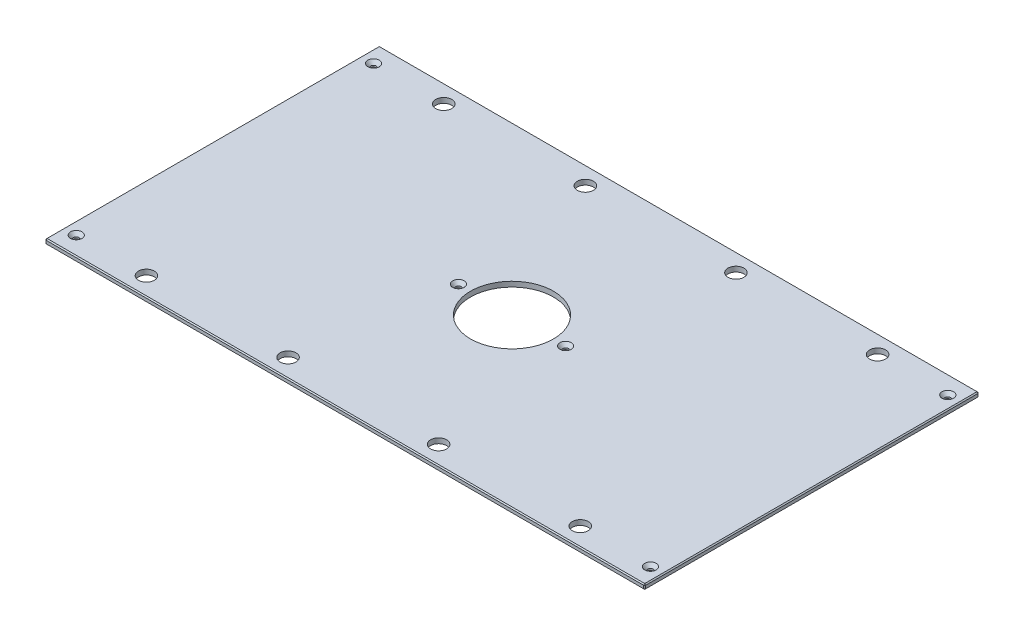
ISO-10303-21;
HEADER;
FILE_DESCRIPTION(('STEP AP214'),'2;1');
FILE_NAME('part.step','',(''),(''),'','','');
FILE_SCHEMA(('AUTOMOTIVE_DESIGN { 1 0 10303 214 1 1 1 1 }'));
ENDSEC;
DATA;
#1=APPLICATION_CONTEXT('core data for automotive mechanical design processes');
#2=APPLICATION_PROTOCOL_DEFINITION('international standard','automotive_design',2000,#1);
#3=PRODUCT_CONTEXT('',#1,'mechanical');
#4=PRODUCT('Part','Part','',(#3));
#5=PRODUCT_RELATED_PRODUCT_CATEGORY('part','',(#4));
#6=PRODUCT_DEFINITION_FORMATION('','',#4);
#7=PRODUCT_DEFINITION_CONTEXT('part definition',#1,'design');
#8=PRODUCT_DEFINITION('design','',#6,#7);
#9=PRODUCT_DEFINITION_SHAPE('','',#8);
#10=(LENGTH_UNIT() NAMED_UNIT(*) SI_UNIT(.MILLI.,.METRE.));
#11=(NAMED_UNIT(*) PLANE_ANGLE_UNIT() SI_UNIT($,.RADIAN.));
#12=(NAMED_UNIT(*) SI_UNIT($,.STERADIAN.) SOLID_ANGLE_UNIT());
#13=UNCERTAINTY_MEASURE_WITH_UNIT(LENGTH_MEASURE(1.E-05),#10,'distance_accuracy_value','');
#14=(GEOMETRIC_REPRESENTATION_CONTEXT(3) GLOBAL_UNCERTAINTY_ASSIGNED_CONTEXT((#13)) GLOBAL_UNIT_ASSIGNED_CONTEXT((#10,
#11,#12)) REPRESENTATION_CONTEXT('',''));
#15=CARTESIAN_POINT('',(0.,0.,0.));
#16=DIRECTION('',(0.,0.,1.));
#17=DIRECTION('',(1.,0.,0.));
#18=AXIS2_PLACEMENT_3D('',#15,#16,#17);
#19=CARTESIAN_POINT('',(-373.0625,6.35,-207.9625));
#20=DIRECTION('',(1.,0.,0.));
#21=DIRECTION('',(0.,0.,-1.));
#22=AXIS2_PLACEMENT_3D('',#19,#20,#21);
#23=PLANE('',#22);
#24=DIRECTION('',(0.,0.,-1.));
#25=VECTOR('',#24,1.);
#26=CARTESIAN_POINT('',(-373.0625,5.08000000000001,-207.9625));
#27=LINE('',#26,#25);
#28=CARTESIAN_POINT('',(-373.0625,5.08000000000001,206.6925));
#29=VERTEX_POINT('',#28);
#30=CARTESIAN_POINT('',(-373.0625,5.08000000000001,-206.6925));
#31=VERTEX_POINT('',#30);
#32=EDGE_CURVE('E140',#29,#31,#27,.T.);
#33=ORIENTED_EDGE('',*,*,#32,.T.);
#34=DIRECTION('',(0.,-1.,0.));
#35=VECTOR('',#34,1.);
#36=CARTESIAN_POINT('',(-373.0625,6.35,-206.6925));
#37=LINE('',#36,#35);
#38=CARTESIAN_POINT('',(-373.0625,1.26999999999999,-206.6925));
#39=VERTEX_POINT('',#38);
#40=EDGE_CURVE('E135',#31,#39,#37,.T.);
#41=ORIENTED_EDGE('',*,*,#40,.T.);
#42=DIRECTION('',(0.,0.,1.));
#43=VECTOR('',#42,1.);
#44=CARTESIAN_POINT('',(-373.0625,1.26999999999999,-207.9625));
#45=LINE('',#44,#43);
#46=CARTESIAN_POINT('',(-373.0625,1.26999999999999,206.6925));
#47=VERTEX_POINT('',#46);
#48=EDGE_CURVE('E130',#39,#47,#45,.T.);
#49=ORIENTED_EDGE('',*,*,#48,.T.);
#50=DIRECTION('',(0.,1.,0.));
#51=VECTOR('',#50,1.);
#52=CARTESIAN_POINT('',(-373.0625,6.35,206.6925));
#53=LINE('',#52,#51);
#54=EDGE_CURVE('E132',#47,#29,#53,.T.);
#55=ORIENTED_EDGE('',*,*,#54,.T.);
#56=EDGE_LOOP('',(#33,#41,#49,#55));
#57=FACE_BOUND('',#56,.T.);
#58=ADVANCED_FACE('F38',(#57),#23,.F.);
#59=CARTESIAN_POINT('',(-373.0625,6.35,207.9625));
#60=DIRECTION('',(0.,0.,-1.));
#61=DIRECTION('',(-1.,0.,0.));
#62=AXIS2_PLACEMENT_3D('',#59,#60,#61);
#63=PLANE('',#62);
#64=DIRECTION('',(1.,0.,0.));
#65=VECTOR('',#64,1.);
#66=CARTESIAN_POINT('',(-373.0625,1.2700000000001,207.9625));
#67=LINE('',#66,#65);
#68=CARTESIAN_POINT('',(-371.7925,1.2700000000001,207.9625));
#69=VERTEX_POINT('',#68);
#70=CARTESIAN_POINT('',(371.7925,1.2700000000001,207.9625));
#71=VERTEX_POINT('',#70);
#72=EDGE_CURVE('E62',#69,#71,#67,.T.);
#73=ORIENTED_EDGE('',*,*,#72,.T.);
#74=DIRECTION('',(0.,1.,0.));
#75=VECTOR('',#74,1.);
#76=CARTESIAN_POINT('',(371.7925,6.35,207.9625));
#77=LINE('',#76,#75);
#78=CARTESIAN_POINT('',(371.7925,5.0799999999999,207.9625));
#79=VERTEX_POINT('',#78);
#80=EDGE_CURVE('E11',#71,#79,#77,.T.);
#81=ORIENTED_EDGE('',*,*,#80,.T.);
#82=DIRECTION('',(-1.,0.,0.));
#83=VECTOR('',#82,1.);
#84=CARTESIAN_POINT('',(-373.0625,5.0799999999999,207.9625));
#85=LINE('',#84,#83);
#86=CARTESIAN_POINT('',(-371.7925,5.0799999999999,207.9625));
#87=VERTEX_POINT('',#86);
#88=EDGE_CURVE('E48',#79,#87,#85,.T.);
#89=ORIENTED_EDGE('',*,*,#88,.T.);
#90=DIRECTION('',(0.,-1.,0.));
#91=VECTOR('',#90,1.);
#92=CARTESIAN_POINT('',(-371.7925,6.35,207.9625));
#93=LINE('',#92,#91);
#94=EDGE_CURVE('E365',#87,#69,#93,.T.);
#95=ORIENTED_EDGE('',*,*,#94,.T.);
#96=EDGE_LOOP('',(#73,#81,#89,#95));
#97=FACE_BOUND('',#96,.T.);
#98=ADVANCED_FACE('F442',(#97),#63,.F.);
#99=CARTESIAN_POINT('',(373.0625,6.35,-207.9625));
#100=DIRECTION('',(-1.,0.,0.));
#101=DIRECTION('',(0.,0.,1.));
#102=AXIS2_PLACEMENT_3D('',#99,#100,#101);
#103=PLANE('',#102);
#104=DIRECTION('',(0.,0.,-1.));
#105=VECTOR('',#104,1.);
#106=CARTESIAN_POINT('',(373.0625,1.2700000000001,-207.9625));
#107=LINE('',#106,#105);
#108=CARTESIAN_POINT('',(373.0625,1.2700000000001,206.6925));
#109=VERTEX_POINT('',#108);
#110=CARTESIAN_POINT('',(373.0625,1.2700000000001,-206.6925));
#111=VERTEX_POINT('',#110);
#112=EDGE_CURVE('E358',#109,#111,#107,.T.);
#113=ORIENTED_EDGE('',*,*,#112,.T.);
#114=DIRECTION('',(0.,1.,0.));
#115=VECTOR('',#114,1.);
#116=CARTESIAN_POINT('',(373.0625,6.35,-206.6925));
#117=LINE('',#116,#115);
#118=CARTESIAN_POINT('',(373.0625,5.08000000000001,-206.6925));
#119=VERTEX_POINT('',#118);
#120=EDGE_CURVE('E361',#111,#119,#117,.T.);
#121=ORIENTED_EDGE('',*,*,#120,.T.);
#122=DIRECTION('',(0.,0.,1.));
#123=VECTOR('',#122,1.);
#124=CARTESIAN_POINT('',(373.0625,5.08000000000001,207.9625));
#125=LINE('',#124,#123);
#126=CARTESIAN_POINT('',(373.0625,5.08000000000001,206.6925));
#127=VERTEX_POINT('',#126);
#128=EDGE_CURVE('E355',#119,#127,#125,.T.);
#129=ORIENTED_EDGE('',*,*,#128,.T.);
#130=DIRECTION('',(0.,-1.,0.));
#131=VECTOR('',#130,1.);
#132=CARTESIAN_POINT('',(373.0625,6.35,206.6925));
#133=LINE('',#132,#131);
#134=EDGE_CURVE('E352',#127,#109,#133,.T.);
#135=ORIENTED_EDGE('',*,*,#134,.T.);
#136=EDGE_LOOP('',(#113,#121,#129,#135));
#137=FACE_BOUND('',#136,.T.);
#138=ADVANCED_FACE('F429',(#137),#103,.F.);
#139=CARTESIAN_POINT('',(-373.0625,6.35,-207.9625));
#140=DIRECTION('',(0.,0.,1.));
#141=DIRECTION('',(1.,0.,0.));
#142=AXIS2_PLACEMENT_3D('',#139,#140,#141);
#143=PLANE('',#142);
#144=DIRECTION('',(-1.,0.,0.));
#145=VECTOR('',#144,1.);
#146=CARTESIAN_POINT('',(-373.0625,1.2700000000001,-207.9625));
#147=LINE('',#146,#145);
#148=CARTESIAN_POINT('',(371.7925,1.2700000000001,-207.9625));
#149=VERTEX_POINT('',#148);
#150=CARTESIAN_POINT('',(-371.7925,1.2700000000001,-207.9625));
#151=VERTEX_POINT('',#150);
#152=EDGE_CURVE('E318',#149,#151,#147,.T.);
#153=ORIENTED_EDGE('',*,*,#152,.T.);
#154=DIRECTION('',(0.,1.,0.));
#155=VECTOR('',#154,1.);
#156=CARTESIAN_POINT('',(-371.7925,6.35,-207.9625));
#157=LINE('',#156,#155);
#158=CARTESIAN_POINT('',(-371.7925,5.08000000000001,-207.9625));
#159=VERTEX_POINT('',#158);
#160=EDGE_CURVE('E324',#151,#159,#157,.T.);
#161=ORIENTED_EDGE('',*,*,#160,.T.);
#162=DIRECTION('',(1.,0.,0.));
#163=VECTOR('',#162,1.);
#164=CARTESIAN_POINT('',(373.0625,5.08000000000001,-207.9625));
#165=LINE('',#164,#163);
#166=CARTESIAN_POINT('',(371.7925,5.08000000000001,-207.9625));
#167=VERTEX_POINT('',#166);
#168=EDGE_CURVE('E321',#159,#167,#165,.T.);
#169=ORIENTED_EDGE('',*,*,#168,.T.);
#170=DIRECTION('',(0.,-1.,0.));
#171=VECTOR('',#170,1.);
#172=CARTESIAN_POINT('',(371.7925,6.35,-207.9625));
#173=LINE('',#172,#171);
#174=EDGE_CURVE('E315',#167,#149,#173,.T.);
#175=ORIENTED_EDGE('',*,*,#174,.T.);
#176=EDGE_LOOP('',(#153,#161,#169,#175));
#177=FACE_BOUND('',#176,.T.);
#178=ADVANCED_FACE('F403',(#177),#143,.F.);
#179=CARTESIAN_POINT('',(0.,6.35,0.));
#180=DIRECTION('',(0.,1.,0.));
#181=DIRECTION('',(0.,0.,1.));
#182=AXIS2_PLACEMENT_3D('',#179,#180,#181);
#183=PLANE('',#182);
#184=CARTESIAN_POINT('',(357.1875,6.35,-184.94248));
#185=DIRECTION('',(0.,1.,0.));
#186=DIRECTION('',(0.,0.,1.));
#187=AXIS2_PLACEMENT_3D('',#184,#185,#186);
#188=CIRCLE('',#187,7.13740000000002);
#189=CARTESIAN_POINT('',(357.1875,6.35,-177.80508));
#190=VERTEX_POINT('',#189);
#191=EDGE_CURVE('E974',#190,#190,#188,.T.);
#192=ORIENTED_EDGE('',*,*,#191,.F.);
#193=EDGE_LOOP('',(#192));
#194=FACE_BOUND('',#193,.T.);
#195=CARTESIAN_POINT('',(357.1875,6.35,184.94248));
#196=DIRECTION('',(0.,1.,0.));
#197=DIRECTION('',(0.,0.,1.));
#198=AXIS2_PLACEMENT_3D('',#195,#196,#197);
#199=CIRCLE('',#198,7.13740000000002);
#200=CARTESIAN_POINT('',(357.1875,6.35,192.07988));
#201=VERTEX_POINT('',#200);
#202=EDGE_CURVE('E978',#201,#201,#199,.T.);
#203=ORIENTED_EDGE('',*,*,#202,.F.);
#204=EDGE_LOOP('',(#203));
#205=FACE_BOUND('',#204,.T.);
#206=CARTESIAN_POINT('',(-357.1875,6.35,184.94248));
#207=DIRECTION('',(0.,1.,0.));
#208=DIRECTION('',(0.,0.,1.));
#209=AXIS2_PLACEMENT_3D('',#206,#207,#208);
#210=CIRCLE('',#209,7.13740000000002);
#211=CARTESIAN_POINT('',(-357.1875,6.35,192.07988));
#212=VERTEX_POINT('',#211);
#213=EDGE_CURVE('E982',#212,#212,#210,.T.);
#214=ORIENTED_EDGE('',*,*,#213,.F.);
#215=EDGE_LOOP('',(#214));
#216=FACE_BOUND('',#215,.T.);
#217=CARTESIAN_POINT('',(-66.675,6.35,0.));
#218=DIRECTION('',(0.,1.,0.));
#219=DIRECTION('',(0.,0.,1.));
#220=AXIS2_PLACEMENT_3D('',#217,#218,#219);
#221=CIRCLE('',#220,7.1374);
#222=CARTESIAN_POINT('',(-66.675,6.35,7.1374));
#223=VERTEX_POINT('',#222);
#224=EDGE_CURVE('E986',#223,#223,#221,.T.);
#225=ORIENTED_EDGE('',*,*,#224,.F.);
#226=EDGE_LOOP('',(#225));
#227=FACE_BOUND('',#226,.T.);
#228=CARTESIAN_POINT('',(66.675,6.35,0.));
#229=DIRECTION('',(0.,1.,0.));
#230=DIRECTION('',(0.,0.,1.));
#231=AXIS2_PLACEMENT_3D('',#228,#229,#230);
#232=CIRCLE('',#231,7.1374);
#233=CARTESIAN_POINT('',(66.675,6.35,7.1374));
#234=VERTEX_POINT('',#233);
#235=EDGE_CURVE('E990',#234,#234,#232,.T.);
#236=ORIENTED_EDGE('',*,*,#235,.F.);
#237=EDGE_LOOP('',(#236));
#238=FACE_BOUND('',#237,.T.);
#239=CARTESIAN_POINT('',(-357.1875,6.35,-184.94248));
#240=DIRECTION('',(0.,1.,0.));
#241=DIRECTION('',(0.,0.,1.));
#242=AXIS2_PLACEMENT_3D('',#239,#240,#241);
#243=CIRCLE('',#242,7.13740000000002);
#244=CARTESIAN_POINT('',(-357.1875,6.35,-177.80508));
#245=VERTEX_POINT('',#244);
#246=EDGE_CURVE('E993',#245,#245,#243,.T.);
#247=ORIENTED_EDGE('',*,*,#246,.F.);
#248=EDGE_LOOP('',(#247));
#249=FACE_BOUND('',#248,.T.);
#250=DIRECTION('',(0.,0.,-1.));
#251=VECTOR('',#250,1.);
#252=CARTESIAN_POINT('',(371.7925,6.35,-207.9625));
#253=LINE('',#252,#251);
#254=CARTESIAN_POINT('',(371.7925,6.35,206.6925));
#255=VERTEX_POINT('',#254);
#256=CARTESIAN_POINT('',(371.7925,6.35,-206.6925));
#257=VERTEX_POINT('',#256);
#258=EDGE_CURVE('E334',#255,#257,#253,.T.);
#259=ORIENTED_EDGE('',*,*,#258,.T.);
#260=DIRECTION('',(-1.,0.,0.));
#261=VECTOR('',#260,1.);
#262=CARTESIAN_POINT('',(-373.0625,6.35,-206.6925));
#263=LINE('',#262,#261);
#264=CARTESIAN_POINT('',(-371.7925,6.35,-206.6925));
#265=VERTEX_POINT('',#264);
#266=EDGE_CURVE('E336',#257,#265,#263,.T.);
#267=ORIENTED_EDGE('',*,*,#266,.T.);
#268=DIRECTION('',(0.,0.,1.));
#269=VECTOR('',#268,1.);
#270=CARTESIAN_POINT('',(-371.7925,6.35,207.9625));
#271=LINE('',#270,#269);
#272=CARTESIAN_POINT('',(-371.7925,6.35,206.6925));
#273=VERTEX_POINT('',#272);
#274=EDGE_CURVE('E331',#265,#273,#271,.T.);
#275=ORIENTED_EDGE('',*,*,#274,.T.);
#276=DIRECTION('',(1.,0.,0.));
#277=VECTOR('',#276,1.);
#278=CARTESIAN_POINT('',(373.0625,6.35,206.6925));
#279=LINE('',#278,#277);
#280=EDGE_CURVE('E328',#273,#255,#279,.T.);
#281=ORIENTED_EDGE('',*,*,#280,.T.);
#282=EDGE_LOOP('',(#259,#267,#275,#281));
#283=FACE_BOUND('',#282,.T.);
#284=CARTESIAN_POINT('',(269.875,6.35,-184.94248));
#285=DIRECTION('',(0.,1.,0.));
#286=DIRECTION('',(0.,0.,1.));
#287=AXIS2_PLACEMENT_3D('',#284,#285,#286);
#288=CIRCLE('',#287,9.92187500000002);
#289=CARTESIAN_POINT('',(269.875,6.35,-175.020605));
#290=VERTEX_POINT('',#289);
#291=EDGE_CURVE('E230',#290,#290,#288,.T.);
#292=ORIENTED_EDGE('',*,*,#291,.F.);
#293=EDGE_LOOP('',(#292));
#294=FACE_BOUND('',#293,.T.);
#295=CARTESIAN_POINT('',(-269.875,6.35,-184.94248));
#296=DIRECTION('',(0.,1.,0.));
#297=DIRECTION('',(0.,0.,1.));
#298=AXIS2_PLACEMENT_3D('',#295,#296,#297);
#299=CIRCLE('',#298,9.92187500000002);
#300=CARTESIAN_POINT('',(-269.875,6.35,-175.020605));
#301=VERTEX_POINT('',#300);
#302=EDGE_CURVE('E245',#301,#301,#299,.T.);
#303=ORIENTED_EDGE('',*,*,#302,.F.);
#304=EDGE_LOOP('',(#303));
#305=FACE_BOUND('',#304,.T.);
#306=CARTESIAN_POINT('',(269.875,6.35,184.94248));
#307=DIRECTION('',(0.,1.,0.));
#308=DIRECTION('',(0.,0.,1.));
#309=AXIS2_PLACEMENT_3D('',#306,#307,#308);
#310=CIRCLE('',#309,9.92187500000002);
#311=CARTESIAN_POINT('',(269.875,6.35,194.864355));
#312=VERTEX_POINT('',#311);
#313=EDGE_CURVE('E258',#312,#312,#310,.T.);
#314=ORIENTED_EDGE('',*,*,#313,.F.);
#315=EDGE_LOOP('',(#314));
#316=FACE_BOUND('',#315,.T.);
#317=CARTESIAN_POINT('',(-269.875,6.35,184.94248));
#318=DIRECTION('',(0.,1.,0.));
#319=DIRECTION('',(0.,0.,1.));
#320=AXIS2_PLACEMENT_3D('',#317,#318,#319);
#321=CIRCLE('',#320,9.92187500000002);
#322=CARTESIAN_POINT('',(-269.875,6.35,194.864355));
#323=VERTEX_POINT('',#322);
#324=EDGE_CURVE('E266',#323,#323,#321,.T.);
#325=ORIENTED_EDGE('',*,*,#324,.F.);
#326=EDGE_LOOP('',(#325));
#327=FACE_BOUND('',#326,.T.);
#328=CARTESIAN_POINT('',(-93.6625,6.35,-184.94248));
#329=DIRECTION('',(0.,1.,0.));
#330=DIRECTION('',(0.,0.,1.));
#331=AXIS2_PLACEMENT_3D('',#328,#329,#330);
#332=CIRCLE('',#331,9.921875);
#333=CARTESIAN_POINT('',(-93.6625,6.35,-175.020605));
#334=VERTEX_POINT('',#333);
#335=EDGE_CURVE('E274',#334,#334,#332,.T.);
#336=ORIENTED_EDGE('',*,*,#335,.F.);
#337=EDGE_LOOP('',(#336));
#338=FACE_BOUND('',#337,.T.);
#339=CARTESIAN_POINT('',(93.6625,6.35,-184.94248));
#340=DIRECTION('',(0.,1.,0.));
#341=DIRECTION('',(0.,0.,1.));
#342=AXIS2_PLACEMENT_3D('',#339,#340,#341);
#343=CIRCLE('',#342,9.921875);
#344=CARTESIAN_POINT('',(93.6625,6.35,-175.020605));
#345=VERTEX_POINT('',#344);
#346=EDGE_CURVE('E282',#345,#345,#343,.T.);
#347=ORIENTED_EDGE('',*,*,#346,.F.);
#348=EDGE_LOOP('',(#347));
#349=FACE_BOUND('',#348,.T.);
#350=CARTESIAN_POINT('',(93.6625,6.35,184.94248));
#351=DIRECTION('',(0.,1.,0.));
#352=DIRECTION('',(0.,0.,1.));
#353=AXIS2_PLACEMENT_3D('',#350,#351,#352);
#354=CIRCLE('',#353,9.921875);
#355=CARTESIAN_POINT('',(93.6625,6.35,194.864355));
#356=VERTEX_POINT('',#355);
#357=EDGE_CURVE('E289',#356,#356,#354,.T.);
#358=ORIENTED_EDGE('',*,*,#357,.F.);
#359=EDGE_LOOP('',(#358));
#360=FACE_BOUND('',#359,.T.);
#361=CARTESIAN_POINT('',(-93.6625,6.35,184.94248));
#362=DIRECTION('',(0.,1.,0.));
#363=DIRECTION('',(0.,0.,1.));
#364=AXIS2_PLACEMENT_3D('',#361,#362,#363);
#365=CIRCLE('',#364,9.921875);
#366=CARTESIAN_POINT('',(-93.6625,6.35,194.864355));
#367=VERTEX_POINT('',#366);
#368=EDGE_CURVE('E297',#367,#367,#365,.T.);
#369=ORIENTED_EDGE('',*,*,#368,.F.);
#370=EDGE_LOOP('',(#369));
#371=FACE_BOUND('',#370,.T.);
#372=CARTESIAN_POINT('',(0.,6.35,0.));
#373=DIRECTION('',(0.,1.,0.));
#374=DIRECTION('',(0.,0.,1.));
#375=AXIS2_PLACEMENT_3D('',#372,#373,#374);
#376=CIRCLE('',#375,51.562);
#377=CARTESIAN_POINT('',(0.,6.35,51.562));
#378=VERTEX_POINT('',#377);
#379=EDGE_CURVE('E304',#378,#378,#376,.T.);
#380=ORIENTED_EDGE('',*,*,#379,.F.);
#381=EDGE_LOOP('',(#380));
#382=FACE_BOUND('',#381,.T.);
#383=ADVANCED_FACE('F451',(#194,#205,#216,#227,#238,#249,#283,#294,#305,#316,#327,#338,#349,
#360,#371,#382),#183,.T.);
#384=CARTESIAN_POINT('',(0.,0.,0.));
#385=DIRECTION('',(0.,1.,0.));
#386=DIRECTION('',(0.,0.,1.));
#387=AXIS2_PLACEMENT_3D('',#384,#385,#386);
#388=PLANE('',#387);
#389=CARTESIAN_POINT('',(357.1875,0.,-184.94248));
#390=DIRECTION('',(0.,1.,0.));
#391=DIRECTION('',(0.,0.,1.));
#392=AXIS2_PLACEMENT_3D('',#389,#390,#391);
#393=CIRCLE('',#392,3.3782);
#394=CARTESIAN_POINT('',(357.1875,0.,-181.56428));
#395=VERTEX_POINT('',#394);
#396=EDGE_CURVE('E1040',#395,#395,#393,.T.);
#397=ORIENTED_EDGE('',*,*,#396,.T.);
#398=EDGE_LOOP('',(#397));
#399=FACE_BOUND('',#398,.T.);
#400=CARTESIAN_POINT('',(357.1875,0.,184.94248));
#401=DIRECTION('',(0.,1.,0.));
#402=DIRECTION('',(0.,0.,1.));
#403=AXIS2_PLACEMENT_3D('',#400,#401,#402);
#404=CIRCLE('',#403,3.3782);
#405=CARTESIAN_POINT('',(357.1875,0.,188.32068));
#406=VERTEX_POINT('',#405);
#407=EDGE_CURVE('E1030',#406,#406,#404,.T.);
#408=ORIENTED_EDGE('',*,*,#407,.T.);
#409=EDGE_LOOP('',(#408));
#410=FACE_BOUND('',#409,.T.);
#411=CARTESIAN_POINT('',(-357.1875,0.,184.94248));
#412=DIRECTION('',(0.,1.,0.));
#413=DIRECTION('',(0.,0.,1.));
#414=AXIS2_PLACEMENT_3D('',#411,#412,#413);
#415=CIRCLE('',#414,3.3782);
#416=CARTESIAN_POINT('',(-357.1875,0.,188.32068));
#417=VERTEX_POINT('',#416);
#418=EDGE_CURVE('E1021',#417,#417,#415,.T.);
#419=ORIENTED_EDGE('',*,*,#418,.T.);
#420=EDGE_LOOP('',(#419));
#421=FACE_BOUND('',#420,.T.);
#422=CARTESIAN_POINT('',(-66.675,0.,0.));
#423=DIRECTION('',(0.,1.,0.));
#424=DIRECTION('',(0.,0.,1.));
#425=AXIS2_PLACEMENT_3D('',#422,#423,#424);
#426=CIRCLE('',#425,3.3782);
#427=CARTESIAN_POINT('',(-66.675,0.,3.3782));
#428=VERTEX_POINT('',#427);
#429=EDGE_CURVE('E1011',#428,#428,#426,.T.);
#430=ORIENTED_EDGE('',*,*,#429,.T.);
#431=EDGE_LOOP('',(#430));
#432=FACE_BOUND('',#431,.T.);
#433=CARTESIAN_POINT('',(66.675,0.,0.));
#434=DIRECTION('',(0.,1.,0.));
#435=DIRECTION('',(0.,0.,1.));
#436=AXIS2_PLACEMENT_3D('',#433,#434,#435);
#437=CIRCLE('',#436,3.3782);
#438=CARTESIAN_POINT('',(66.675,0.,3.3782));
#439=VERTEX_POINT('',#438);
#440=EDGE_CURVE('E997',#439,#439,#437,.T.);
#441=ORIENTED_EDGE('',*,*,#440,.T.);
#442=EDGE_LOOP('',(#441));
#443=FACE_BOUND('',#442,.T.);
#444=CARTESIAN_POINT('',(-357.1875,0.,-184.94248));
#445=DIRECTION('',(0.,1.,0.));
#446=DIRECTION('',(0.,0.,1.));
#447=AXIS2_PLACEMENT_3D('',#444,#445,#446);
#448=CIRCLE('',#447,3.3782);
#449=CARTESIAN_POINT('',(-357.1875,0.,-181.56428));
#450=VERTEX_POINT('',#449);
#451=EDGE_CURVE('E248',#450,#450,#448,.T.);
#452=ORIENTED_EDGE('',*,*,#451,.T.);
#453=EDGE_LOOP('',(#452));
#454=FACE_BOUND('',#453,.T.);
#455=DIRECTION('',(0.,0.,-1.));
#456=VECTOR('',#455,1.);
#457=CARTESIAN_POINT('',(-371.7925,0.,0.));
#458=LINE('',#457,#456);
#459=CARTESIAN_POINT('',(-371.7925,0.,206.6925));
#460=VERTEX_POINT('',#459);
#461=CARTESIAN_POINT('',(-371.7925,0.,-206.6925));
#462=VERTEX_POINT('',#461);
#463=EDGE_CURVE('E165',#460,#462,#458,.T.);
#464=ORIENTED_EDGE('',*,*,#463,.T.);
#465=DIRECTION('',(1.,0.,0.));
#466=VECTOR('',#465,1.);
#467=CARTESIAN_POINT('',(0.,0.,-206.6925));
#468=LINE('',#467,#466);
#469=CARTESIAN_POINT('',(371.7925,0.,-206.6925));
#470=VERTEX_POINT('',#469);
#471=EDGE_CURVE('E348',#462,#470,#468,.T.);
#472=ORIENTED_EDGE('',*,*,#471,.T.);
#473=DIRECTION('',(0.,0.,1.));
#474=VECTOR('',#473,1.);
#475=CARTESIAN_POINT('',(371.7925,0.,0.));
#476=LINE('',#475,#474);
#477=CARTESIAN_POINT('',(371.7925,0.,206.6925));
#478=VERTEX_POINT('',#477);
#479=EDGE_CURVE('E345',#470,#478,#476,.T.);
#480=ORIENTED_EDGE('',*,*,#479,.T.);
#481=DIRECTION('',(-1.,0.,0.));
#482=VECTOR('',#481,1.);
#483=CARTESIAN_POINT('',(0.,0.,206.6925));
#484=LINE('',#483,#482);
#485=EDGE_CURVE('E340',#478,#460,#484,.T.);
#486=ORIENTED_EDGE('',*,*,#485,.T.);
#487=EDGE_LOOP('',(#464,#472,#480,#486));
#488=FACE_BOUND('',#487,.T.);
#489=CARTESIAN_POINT('',(269.875,0.,-184.94248));
#490=DIRECTION('',(0.,1.,0.));
#491=DIRECTION('',(0.,0.,1.));
#492=AXIS2_PLACEMENT_3D('',#489,#490,#491);
#493=CIRCLE('',#492,9.92187500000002);
#494=CARTESIAN_POINT('',(269.875,0.,-175.020605));
#495=VERTEX_POINT('',#494);
#496=EDGE_CURVE('E237',#495,#495,#493,.T.);
#497=ORIENTED_EDGE('',*,*,#496,.T.);
#498=EDGE_LOOP('',(#497));
#499=FACE_BOUND('',#498,.T.);
#500=CARTESIAN_POINT('',(-269.875,0.,-184.94248));
#501=DIRECTION('',(0.,1.,0.));
#502=DIRECTION('',(0.,0.,1.));
#503=AXIS2_PLACEMENT_3D('',#500,#501,#502);
#504=CIRCLE('',#503,9.92187500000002);
#505=CARTESIAN_POINT('',(-269.875,0.,-175.020605));
#506=VERTEX_POINT('',#505);
#507=EDGE_CURVE('E254',#506,#506,#504,.T.);
#508=ORIENTED_EDGE('',*,*,#507,.T.);
#509=EDGE_LOOP('',(#508));
#510=FACE_BOUND('',#509,.T.);
#511=CARTESIAN_POINT('',(269.875,0.,184.94248));
#512=DIRECTION('',(0.,1.,0.));
#513=DIRECTION('',(0.,0.,1.));
#514=AXIS2_PLACEMENT_3D('',#511,#512,#513);
#515=CIRCLE('',#514,9.92187500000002);
#516=CARTESIAN_POINT('',(269.875,0.,194.864355));
#517=VERTEX_POINT('',#516);
#518=EDGE_CURVE('E262',#517,#517,#515,.T.);
#519=ORIENTED_EDGE('',*,*,#518,.T.);
#520=EDGE_LOOP('',(#519));
#521=FACE_BOUND('',#520,.T.);
#522=CARTESIAN_POINT('',(-269.875,0.,184.94248));
#523=DIRECTION('',(0.,1.,0.));
#524=DIRECTION('',(0.,0.,1.));
#525=AXIS2_PLACEMENT_3D('',#522,#523,#524);
#526=CIRCLE('',#525,9.92187500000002);
#527=CARTESIAN_POINT('',(-269.875,0.,194.864355));
#528=VERTEX_POINT('',#527);
#529=EDGE_CURVE('E270',#528,#528,#526,.T.);
#530=ORIENTED_EDGE('',*,*,#529,.T.);
#531=EDGE_LOOP('',(#530));
#532=FACE_BOUND('',#531,.T.);
#533=CARTESIAN_POINT('',(-93.6625,0.,-184.94248));
#534=DIRECTION('',(0.,1.,0.));
#535=DIRECTION('',(0.,0.,1.));
#536=AXIS2_PLACEMENT_3D('',#533,#534,#535);
#537=CIRCLE('',#536,9.921875);
#538=CARTESIAN_POINT('',(-93.6625,0.,-175.020605));
#539=VERTEX_POINT('',#538);
#540=EDGE_CURVE('E278',#539,#539,#537,.T.);
#541=ORIENTED_EDGE('',*,*,#540,.T.);
#542=EDGE_LOOP('',(#541));
#543=FACE_BOUND('',#542,.T.);
#544=CARTESIAN_POINT('',(93.6625,0.,-184.94248));
#545=DIRECTION('',(0.,1.,0.));
#546=DIRECTION('',(0.,0.,1.));
#547=AXIS2_PLACEMENT_3D('',#544,#545,#546);
#548=CIRCLE('',#547,9.921875);
#549=CARTESIAN_POINT('',(93.6625,0.,-175.020605));
#550=VERTEX_POINT('',#549);
#551=EDGE_CURVE('E286',#550,#550,#548,.T.);
#552=ORIENTED_EDGE('',*,*,#551,.T.);
#553=EDGE_LOOP('',(#552));
#554=FACE_BOUND('',#553,.T.);
#555=CARTESIAN_POINT('',(93.6625,0.,184.94248));
#556=DIRECTION('',(0.,1.,0.));
#557=DIRECTION('',(0.,0.,1.));
#558=AXIS2_PLACEMENT_3D('',#555,#556,#557);
#559=CIRCLE('',#558,9.921875);
#560=CARTESIAN_POINT('',(93.6625,0.,194.864355));
#561=VERTEX_POINT('',#560);
#562=EDGE_CURVE('E293',#561,#561,#559,.T.);
#563=ORIENTED_EDGE('',*,*,#562,.T.);
#564=EDGE_LOOP('',(#563));
#565=FACE_BOUND('',#564,.T.);
#566=CARTESIAN_POINT('',(-93.6625,0.,184.94248));
#567=DIRECTION('',(0.,1.,0.));
#568=DIRECTION('',(0.,0.,1.));
#569=AXIS2_PLACEMENT_3D('',#566,#567,#568);
#570=CIRCLE('',#569,9.921875);
#571=CARTESIAN_POINT('',(-93.6625,0.,194.864355));
#572=VERTEX_POINT('',#571);
#573=EDGE_CURVE('E301',#572,#572,#570,.T.);
#574=ORIENTED_EDGE('',*,*,#573,.T.);
#575=EDGE_LOOP('',(#574));
#576=FACE_BOUND('',#575,.T.);
#577=CARTESIAN_POINT('',(0.,0.,0.));
#578=DIRECTION('',(0.,1.,0.));
#579=DIRECTION('',(0.,0.,1.));
#580=AXIS2_PLACEMENT_3D('',#577,#578,#579);
#581=CIRCLE('',#580,51.562);
#582=CARTESIAN_POINT('',(0.,0.,51.562));
#583=VERTEX_POINT('',#582);
#584=EDGE_CURVE('E153',#583,#583,#581,.T.);
#585=ORIENTED_EDGE('',*,*,#584,.T.);
#586=EDGE_LOOP('',(#585));
#587=FACE_BOUND('',#586,.T.);
#588=ADVANCED_FACE('F416',(#399,#410,#421,#432,#443,#454,#488,#499,#510,#521,#532,#543,#554,
#565,#576,#587),#388,.F.);
#589=CARTESIAN_POINT('',(0.,0.,0.));
#590=DIRECTION('',(0.,1.,0.));
#591=DIRECTION('',(0.,0.,1.));
#592=AXIS2_PLACEMENT_3D('',#589,#590,#591);
#593=CYLINDRICAL_SURFACE('',#592,51.562);
#594=ORIENTED_EDGE('',*,*,#584,.F.);
#595=EDGE_LOOP('',(#594));
#596=FACE_BOUND('',#595,.T.);
#597=ORIENTED_EDGE('',*,*,#379,.T.);
#598=EDGE_LOOP('',(#597));
#599=FACE_BOUND('',#598,.T.);
#600=ADVANCED_FACE('F697',(#596,#599),#593,.F.);
#601=CARTESIAN_POINT('',(-93.6625,6.35,184.94248));
#602=DIRECTION('',(0.,1.,0.));
#603=DIRECTION('',(0.,0.,1.));
#604=AXIS2_PLACEMENT_3D('',#601,#602,#603);
#605=CYLINDRICAL_SURFACE('',#604,9.921875);
#606=ORIENTED_EDGE('',*,*,#573,.F.);
#607=EDGE_LOOP('',(#606));
#608=FACE_BOUND('',#607,.T.);
#609=ORIENTED_EDGE('',*,*,#368,.T.);
#610=EDGE_LOOP('',(#609));
#611=FACE_BOUND('',#610,.T.);
#612=ADVANCED_FACE('F891',(#608,#611),#605,.F.);
#613=CARTESIAN_POINT('',(93.6625,6.35,184.94248));
#614=DIRECTION('',(0.,1.,0.));
#615=DIRECTION('',(0.,0.,1.));
#616=AXIS2_PLACEMENT_3D('',#613,#614,#615);
#617=CYLINDRICAL_SURFACE('',#616,9.921875);
#618=ORIENTED_EDGE('',*,*,#562,.F.);
#619=EDGE_LOOP('',(#618));
#620=FACE_BOUND('',#619,.T.);
#621=ORIENTED_EDGE('',*,*,#357,.T.);
#622=EDGE_LOOP('',(#621));
#623=FACE_BOUND('',#622,.T.);
#624=ADVANCED_FACE('F881',(#620,#623),#617,.F.);
#625=CARTESIAN_POINT('',(93.6625,6.35,-184.94248));
#626=DIRECTION('',(0.,1.,0.));
#627=DIRECTION('',(0.,0.,1.));
#628=AXIS2_PLACEMENT_3D('',#625,#626,#627);
#629=CYLINDRICAL_SURFACE('',#628,9.921875);
#630=ORIENTED_EDGE('',*,*,#551,.F.);
#631=EDGE_LOOP('',(#630));
#632=FACE_BOUND('',#631,.T.);
#633=ORIENTED_EDGE('',*,*,#346,.T.);
#634=EDGE_LOOP('',(#633));
#635=FACE_BOUND('',#634,.T.);
#636=ADVANCED_FACE('F871',(#632,#635),#629,.F.);
#637=CARTESIAN_POINT('',(-93.6625,6.35,-184.94248));
#638=DIRECTION('',(0.,1.,0.));
#639=DIRECTION('',(0.,0.,1.));
#640=AXIS2_PLACEMENT_3D('',#637,#638,#639);
#641=CYLINDRICAL_SURFACE('',#640,9.921875);
#642=ORIENTED_EDGE('',*,*,#540,.F.);
#643=EDGE_LOOP('',(#642));
#644=FACE_BOUND('',#643,.T.);
#645=ORIENTED_EDGE('',*,*,#335,.T.);
#646=EDGE_LOOP('',(#645));
#647=FACE_BOUND('',#646,.T.);
#648=ADVANCED_FACE('F861',(#644,#647),#641,.F.);
#649=CARTESIAN_POINT('',(-269.875,6.35,184.94248));
#650=DIRECTION('',(0.,1.,0.));
#651=DIRECTION('',(0.,0.,1.));
#652=AXIS2_PLACEMENT_3D('',#649,#650,#651);
#653=CYLINDRICAL_SURFACE('',#652,9.92187500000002);
#654=ORIENTED_EDGE('',*,*,#529,.F.);
#655=EDGE_LOOP('',(#654));
#656=FACE_BOUND('',#655,.T.);
#657=ORIENTED_EDGE('',*,*,#324,.T.);
#658=EDGE_LOOP('',(#657));
#659=FACE_BOUND('',#658,.T.);
#660=ADVANCED_FACE('F851',(#656,#659),#653,.F.);
#661=CARTESIAN_POINT('',(269.875,6.35,184.94248));
#662=DIRECTION('',(0.,1.,0.));
#663=DIRECTION('',(0.,0.,1.));
#664=AXIS2_PLACEMENT_3D('',#661,#662,#663);
#665=CYLINDRICAL_SURFACE('',#664,9.92187500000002);
#666=ORIENTED_EDGE('',*,*,#518,.F.);
#667=EDGE_LOOP('',(#666));
#668=FACE_BOUND('',#667,.T.);
#669=ORIENTED_EDGE('',*,*,#313,.T.);
#670=EDGE_LOOP('',(#669));
#671=FACE_BOUND('',#670,.T.);
#672=ADVANCED_FACE('F841',(#668,#671),#665,.F.);
#673=CARTESIAN_POINT('',(-269.875,6.35,-184.94248));
#674=DIRECTION('',(0.,1.,0.));
#675=DIRECTION('',(0.,0.,1.));
#676=AXIS2_PLACEMENT_3D('',#673,#674,#675);
#677=CYLINDRICAL_SURFACE('',#676,9.92187500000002);
#678=ORIENTED_EDGE('',*,*,#507,.F.);
#679=EDGE_LOOP('',(#678));
#680=FACE_BOUND('',#679,.T.);
#681=ORIENTED_EDGE('',*,*,#302,.T.);
#682=EDGE_LOOP('',(#681));
#683=FACE_BOUND('',#682,.T.);
#684=ADVANCED_FACE('F831',(#680,#683),#677,.F.);
#685=CARTESIAN_POINT('',(269.875,6.35,-184.94248));
#686=DIRECTION('',(0.,1.,0.));
#687=DIRECTION('',(0.,0.,1.));
#688=AXIS2_PLACEMENT_3D('',#685,#686,#687);
#689=CYLINDRICAL_SURFACE('',#688,9.92187500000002);
#690=ORIENTED_EDGE('',*,*,#496,.F.);
#691=EDGE_LOOP('',(#690));
#692=FACE_BOUND('',#691,.T.);
#693=ORIENTED_EDGE('',*,*,#291,.T.);
#694=EDGE_LOOP('',(#693));
#695=FACE_BOUND('',#694,.T.);
#696=ADVANCED_FACE('F460',(#692,#695),#689,.F.);
#697=CARTESIAN_POINT('',(373.0625,6.35,206.6925));
#698=DIRECTION('',(-0.707106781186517,0.,-0.707106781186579));
#699=DIRECTION('',(0.,-1.,0.));
#700=AXIS2_PLACEMENT_3D('',#697,#698,#699);
#701=PLANE('',#700);
#702=DIRECTION('',(-0.707106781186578,0.,0.707106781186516));
#703=VECTOR('',#702,1.);
#704=CARTESIAN_POINT('',(373.0625,5.08000000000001,206.6925));
#705=LINE('',#704,#703);
#706=EDGE_CURVE('E42',#79,#127,#705,.F.);
#707=ORIENTED_EDGE('',*,*,#706,.F.);
#708=ORIENTED_EDGE('',*,*,#80,.F.);
#709=DIRECTION('',(0.707106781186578,0.,-0.707106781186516));
#710=VECTOR('',#709,1.);
#711=CARTESIAN_POINT('',(372.4275,1.2700000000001,207.3275));
#712=LINE('',#711,#710);
#713=EDGE_CURVE('E221',#109,#71,#712,.F.);
#714=ORIENTED_EDGE('',*,*,#713,.F.);
#715=ORIENTED_EDGE('',*,*,#134,.F.);
#716=EDGE_LOOP('',(#707,#708,#714,#715));
#717=FACE_BOUND('',#716,.T.);
#718=ADVANCED_FACE('F40',(#717),#701,.F.);
#719=CARTESIAN_POINT('',(373.0625,5.08000000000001,206.6925));
#720=DIRECTION('',(0.577350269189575,0.577350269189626,0.577350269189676));
#721=DIRECTION('',(0.,-0.707106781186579,0.707106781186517));
#722=AXIS2_PLACEMENT_3D('',#719,#720,#721);
#723=PLANE('',#722);
#724=DIRECTION('',(0.,-0.707106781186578,0.707106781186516));
#725=VECTOR('',#724,1.);
#726=CARTESIAN_POINT('',(371.7925,5.71499999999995,207.3275));
#727=LINE('',#726,#725);
#728=EDGE_CURVE('E215',#79,#255,#727,.F.);
#729=ORIENTED_EDGE('',*,*,#728,.F.);
#730=ORIENTED_EDGE('',*,*,#706,.T.);
#731=DIRECTION('',(-0.707106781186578,0.707106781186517,0.));
#732=VECTOR('',#731,1.);
#733=CARTESIAN_POINT('',(373.0625,5.08000000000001,206.6925));
#734=LINE('',#733,#732);
#735=EDGE_CURVE('E218',#255,#127,#734,.F.);
#736=ORIENTED_EDGE('',*,*,#735,.F.);
#737=EDGE_LOOP('',(#729,#730,#736));
#738=FACE_BOUND('',#737,.T.);
#739=ADVANCED_FACE('F453',(#738),#723,.T.);
#740=CARTESIAN_POINT('',(371.7925,0.,206.6925));
#741=DIRECTION('',(0.577350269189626,-0.577350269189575,0.577350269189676));
#742=DIRECTION('',(0.707106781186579,0.,-0.707106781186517));
#743=AXIS2_PLACEMENT_3D('',#740,#741,#742);
#744=PLANE('',#743);
#745=DIRECTION('',(-0.707106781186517,-0.707106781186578,0.));
#746=VECTOR('',#745,1.);
#747=CARTESIAN_POINT('',(371.7925,0.,206.6925));
#748=LINE('',#747,#746);
#749=EDGE_CURVE('E207',#109,#478,#748,.T.);
#750=ORIENTED_EDGE('',*,*,#749,.F.);
#751=ORIENTED_EDGE('',*,*,#713,.T.);
#752=DIRECTION('',(0.,0.707106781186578,0.707106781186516));
#753=VECTOR('',#752,1.);
#754=CARTESIAN_POINT('',(371.7925,0.,206.6925));
#755=LINE('',#754,#753);
#756=EDGE_CURVE('E211',#478,#71,#755,.T.);
#757=ORIENTED_EDGE('',*,*,#756,.F.);
#758=EDGE_LOOP('',(#750,#751,#757));
#759=FACE_BOUND('',#758,.T.);
#760=ADVANCED_FACE('F422',(#759),#744,.T.);
#761=CARTESIAN_POINT('',(371.7925,6.35,0.));
#762=DIRECTION('',(0.707106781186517,0.707106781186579,0.));
#763=DIRECTION('',(0.,0.,1.));
#764=AXIS2_PLACEMENT_3D('',#761,#762,#763);
#765=PLANE('',#764);
#766=ORIENTED_EDGE('',*,*,#735,.T.);
#767=ORIENTED_EDGE('',*,*,#128,.F.);
#768=DIRECTION('',(0.707106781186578,-0.707106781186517,0.));
#769=VECTOR('',#768,1.);
#770=CARTESIAN_POINT('',(372.4275,5.715,-206.6925));
#771=LINE('',#770,#769);
#772=EDGE_CURVE('E200',#257,#119,#771,.T.);
#773=ORIENTED_EDGE('',*,*,#772,.F.);
#774=ORIENTED_EDGE('',*,*,#258,.F.);
#775=EDGE_LOOP('',(#766,#767,#773,#774));
#776=FACE_BOUND('',#775,.T.);
#777=ADVANCED_FACE('F439',(#776),#765,.T.);
#778=CARTESIAN_POINT('',(0.,6.35,206.6925));
#779=DIRECTION('',(0.,0.707106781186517,0.707106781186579));
#780=DIRECTION('',(-1.,0.,0.));
#781=AXIS2_PLACEMENT_3D('',#778,#779,#780);
#782=PLANE('',#781);
#783=ORIENTED_EDGE('',*,*,#728,.T.);
#784=ORIENTED_EDGE('',*,*,#280,.F.);
#785=DIRECTION('',(0.,0.707106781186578,-0.707106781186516));
#786=VECTOR('',#785,1.);
#787=CARTESIAN_POINT('',(-371.7925,6.35,206.6925));
#788=LINE('',#787,#786);
#789=EDGE_CURVE('E196',#87,#273,#788,.T.);
#790=ORIENTED_EDGE('',*,*,#789,.F.);
#791=ORIENTED_EDGE('',*,*,#88,.F.);
#792=EDGE_LOOP('',(#783,#784,#790,#791));
#793=FACE_BOUND('',#792,.T.);
#794=ADVANCED_FACE('F444',(#793),#782,.T.);
#795=CARTESIAN_POINT('',(-371.7925,6.35,207.9625));
#796=DIRECTION('',(0.707106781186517,0.,-0.707106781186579));
#797=DIRECTION('',(0.,-1.,0.));
#798=AXIS2_PLACEMENT_3D('',#795,#796,#797);
#799=PLANE('',#798);
#800=DIRECTION('',(0.707106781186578,0.,0.707106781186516));
#801=VECTOR('',#800,1.);
#802=CARTESIAN_POINT('',(-373.0625,1.26999999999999,206.6925));
#803=LINE('',#802,#801);
#804=EDGE_CURVE('E147',#69,#47,#803,.F.);
#805=ORIENTED_EDGE('',*,*,#804,.F.);
#806=ORIENTED_EDGE('',*,*,#94,.F.);
#807=DIRECTION('',(-0.707106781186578,0.,-0.707106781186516));
#808=VECTOR('',#807,1.);
#809=CARTESIAN_POINT('',(-372.4275,5.07999999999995,207.3275));
#810=LINE('',#809,#808);
#811=EDGE_CURVE('E150',#29,#87,#810,.F.);
#812=ORIENTED_EDGE('',*,*,#811,.F.);
#813=ORIENTED_EDGE('',*,*,#54,.F.);
#814=EDGE_LOOP('',(#805,#806,#812,#813));
#815=FACE_BOUND('',#814,.T.);
#816=ADVANCED_FACE('F145',(#815),#799,.F.);
#817=CARTESIAN_POINT('',(-373.0625,1.2700000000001,207.9625));
#818=DIRECTION('',(0.,0.707106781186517,-0.707106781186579));
#819=DIRECTION('',(1.,0.,0.));
#820=AXIS2_PLACEMENT_3D('',#817,#818,#819);
#821=PLANE('',#820);
#822=ORIENTED_EDGE('',*,*,#756,.T.);
#823=ORIENTED_EDGE('',*,*,#72,.F.);
#824=DIRECTION('',(0.,-0.707106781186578,-0.707106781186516));
#825=VECTOR('',#824,1.);
#826=CARTESIAN_POINT('',(-371.7925,0.635000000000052,207.3275));
#827=LINE('',#826,#825);
#828=EDGE_CURVE('E161',#460,#69,#827,.F.);
#829=ORIENTED_EDGE('',*,*,#828,.F.);
#830=ORIENTED_EDGE('',*,*,#485,.F.);
#831=EDGE_LOOP('',(#822,#823,#829,#830));
#832=FACE_BOUND('',#831,.T.);
#833=ADVANCED_FACE('F421',(#832),#821,.F.);
#834=CARTESIAN_POINT('',(373.0625,1.2700000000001,-207.9625));
#835=DIRECTION('',(-0.707106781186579,0.707106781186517,0.));
#836=DIRECTION('',(0.,0.,-1.));
#837=AXIS2_PLACEMENT_3D('',#834,#835,#836);
#838=PLANE('',#837);
#839=ORIENTED_EDGE('',*,*,#749,.T.);
#840=ORIENTED_EDGE('',*,*,#479,.F.);
#841=DIRECTION('',(0.707106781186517,0.707106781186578,0.));
#842=VECTOR('',#841,1.);
#843=CARTESIAN_POINT('',(371.7925,0.,-206.6925));
#844=LINE('',#843,#842);
#845=EDGE_CURVE('E188',#111,#470,#844,.F.);
#846=ORIENTED_EDGE('',*,*,#845,.F.);
#847=ORIENTED_EDGE('',*,*,#112,.F.);
#848=EDGE_LOOP('',(#839,#840,#846,#847));
#849=FACE_BOUND('',#848,.T.);
#850=ADVANCED_FACE('F426',(#849),#838,.F.);
#851=CARTESIAN_POINT('',(371.7925,6.35,-207.9625));
#852=DIRECTION('',(-0.707106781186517,0.,0.707106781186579));
#853=DIRECTION('',(0.,-1.,0.));
#854=AXIS2_PLACEMENT_3D('',#851,#852,#853);
#855=PLANE('',#854);
#856=DIRECTION('',(0.707106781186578,0.,0.707106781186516));
#857=VECTOR('',#856,1.);
#858=CARTESIAN_POINT('',(371.7925,5.08000000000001,-207.9625));
#859=LINE('',#858,#857);
#860=EDGE_CURVE('E203',#119,#167,#859,.F.);
#861=ORIENTED_EDGE('',*,*,#860,.F.);
#862=ORIENTED_EDGE('',*,*,#120,.F.);
#863=DIRECTION('',(-0.707106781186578,0.,-0.707106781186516));
#864=VECTOR('',#863,1.);
#865=CARTESIAN_POINT('',(372.4275,1.2700000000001,-207.3275));
#866=LINE('',#865,#864);
#867=EDGE_CURVE('E184',#149,#111,#866,.F.);
#868=ORIENTED_EDGE('',*,*,#867,.F.);
#869=ORIENTED_EDGE('',*,*,#174,.F.);
#870=EDGE_LOOP('',(#861,#862,#868,#869));
#871=FACE_BOUND('',#870,.T.);
#872=ADVANCED_FACE('F434',(#871),#855,.F.);
#873=CARTESIAN_POINT('',(371.7925,5.08000000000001,-207.9625));
#874=DIRECTION('',(0.577350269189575,0.577350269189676,-0.577350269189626));
#875=DIRECTION('',(0.,0.707106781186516,0.707106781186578));
#876=AXIS2_PLACEMENT_3D('',#873,#874,#875);
#877=PLANE('',#876);
#878=ORIENTED_EDGE('',*,*,#772,.T.);
#879=ORIENTED_EDGE('',*,*,#860,.T.);
#880=DIRECTION('',(0.,0.707106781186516,0.707106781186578));
#881=VECTOR('',#880,1.);
#882=CARTESIAN_POINT('',(371.7925,5.08000000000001,-207.9625));
#883=LINE('',#882,#881);
#884=EDGE_CURVE('E174',#257,#167,#883,.F.);
#885=ORIENTED_EDGE('',*,*,#884,.F.);
#886=EDGE_LOOP('',(#878,#879,#885));
#887=FACE_BOUND('',#886,.T.);
#888=ADVANCED_FACE('F492',(#887),#877,.T.);
#889=CARTESIAN_POINT('',(-371.7925,6.35,206.6925));
#890=DIRECTION('',(-0.577350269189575,0.577350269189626,0.577350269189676));
#891=DIRECTION('',(0.,-0.707106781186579,0.707106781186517));
#892=AXIS2_PLACEMENT_3D('',#889,#890,#891);
#893=PLANE('',#892);
#894=ORIENTED_EDGE('',*,*,#811,.T.);
#895=ORIENTED_EDGE('',*,*,#789,.T.);
#896=DIRECTION('',(-0.707106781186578,-0.707106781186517,0.));
#897=VECTOR('',#896,1.);
#898=CARTESIAN_POINT('',(-371.7925,6.35,206.6925));
#899=LINE('',#898,#897);
#900=EDGE_CURVE('E167',#29,#273,#899,.F.);
#901=ORIENTED_EDGE('',*,*,#900,.F.);
#902=EDGE_LOOP('',(#894,#895,#901));
#903=FACE_BOUND('',#902,.T.);
#904=ADVANCED_FACE('F446',(#903),#893,.T.);
#905=CARTESIAN_POINT('',(-373.0625,1.26999999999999,206.6925));
#906=DIRECTION('',(-0.577350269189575,-0.577350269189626,0.577350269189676));
#907=DIRECTION('',(0.,-0.707106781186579,-0.707106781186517));
#908=AXIS2_PLACEMENT_3D('',#905,#906,#907);
#909=PLANE('',#908);
#910=ORIENTED_EDGE('',*,*,#828,.T.);
#911=ORIENTED_EDGE('',*,*,#804,.T.);
#912=DIRECTION('',(-0.707106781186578,0.707106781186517,0.));
#913=VECTOR('',#912,1.);
#914=CARTESIAN_POINT('',(-373.0625,1.26999999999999,206.6925));
#915=LINE('',#914,#913);
#916=EDGE_CURVE('E158',#460,#47,#915,.T.);
#917=ORIENTED_EDGE('',*,*,#916,.F.);
#918=EDGE_LOOP('',(#910,#911,#917));
#919=FACE_BOUND('',#918,.T.);
#920=ADVANCED_FACE('F157',(#919),#909,.T.);
#921=CARTESIAN_POINT('',(371.7925,0.,-206.6925));
#922=DIRECTION('',(0.577350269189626,-0.577350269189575,-0.577350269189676));
#923=DIRECTION('',(-0.707106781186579,0.,-0.707106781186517));
#924=AXIS2_PLACEMENT_3D('',#921,#922,#923);
#925=PLANE('',#924);
#926=ORIENTED_EDGE('',*,*,#867,.T.);
#927=ORIENTED_EDGE('',*,*,#845,.T.);
#928=DIRECTION('',(0.,-0.707106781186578,0.707106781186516));
#929=VECTOR('',#928,1.);
#930=CARTESIAN_POINT('',(371.7925,0.,-206.6925));
#931=LINE('',#930,#929);
#932=EDGE_CURVE('E168',#149,#470,#931,.T.);
#933=ORIENTED_EDGE('',*,*,#932,.F.);
#934=EDGE_LOOP('',(#926,#927,#933));
#935=FACE_BOUND('',#934,.T.);
#936=ADVANCED_FACE('F484',(#935),#925,.T.);
#937=CARTESIAN_POINT('',(0.,6.35,-206.6925));
#938=DIRECTION('',(0.,0.707106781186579,-0.707106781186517));
#939=DIRECTION('',(1.,0.,0.));
#940=AXIS2_PLACEMENT_3D('',#937,#938,#939);
#941=PLANE('',#940);
#942=ORIENTED_EDGE('',*,*,#884,.T.);
#943=ORIENTED_EDGE('',*,*,#168,.F.);
#944=DIRECTION('',(0.,-0.707106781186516,-0.707106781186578));
#945=VECTOR('',#944,1.);
#946=CARTESIAN_POINT('',(-371.7925,5.08000000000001,-207.9625));
#947=LINE('',#946,#945);
#948=EDGE_CURVE('E177',#265,#159,#947,.T.);
#949=ORIENTED_EDGE('',*,*,#948,.F.);
#950=ORIENTED_EDGE('',*,*,#266,.F.);
#951=EDGE_LOOP('',(#942,#943,#949,#950));
#952=FACE_BOUND('',#951,.T.);
#953=ADVANCED_FACE('F398',(#952),#941,.T.);
#954=CARTESIAN_POINT('',(-371.7925,6.35,0.));
#955=DIRECTION('',(-0.707106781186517,0.707106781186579,0.));
#956=DIRECTION('',(0.,0.,-1.));
#957=AXIS2_PLACEMENT_3D('',#954,#955,#956);
#958=PLANE('',#957);
#959=ORIENTED_EDGE('',*,*,#900,.T.);
#960=ORIENTED_EDGE('',*,*,#274,.F.);
#961=DIRECTION('',(0.707106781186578,0.707106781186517,0.));
#962=VECTOR('',#961,1.);
#963=CARTESIAN_POINT('',(-372.4275,5.715,-206.6925));
#964=LINE('',#963,#962);
#965=EDGE_CURVE('E385',#31,#265,#964,.T.);
#966=ORIENTED_EDGE('',*,*,#965,.F.);
#967=ORIENTED_EDGE('',*,*,#32,.F.);
#968=EDGE_LOOP('',(#959,#960,#966,#967));
#969=FACE_BOUND('',#968,.T.);
#970=ADVANCED_FACE('F449',(#969),#958,.T.);
#971=CARTESIAN_POINT('',(-373.0625,1.26999999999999,-207.9625));
#972=DIRECTION('',(0.707106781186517,0.707106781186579,0.));
#973=DIRECTION('',(0.,0.,1.));
#974=AXIS2_PLACEMENT_3D('',#971,#972,#973);
#975=PLANE('',#974);
#976=ORIENTED_EDGE('',*,*,#916,.T.);
#977=ORIENTED_EDGE('',*,*,#48,.F.);
#978=DIRECTION('',(0.707106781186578,-0.707106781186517,0.));
#979=VECTOR('',#978,1.);
#980=CARTESIAN_POINT('',(-373.0625,1.26999999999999,-206.6925));
#981=LINE('',#980,#979);
#982=EDGE_CURVE('E381',#462,#39,#981,.F.);
#983=ORIENTED_EDGE('',*,*,#982,.F.);
#984=ORIENTED_EDGE('',*,*,#463,.F.);
#985=EDGE_LOOP('',(#976,#977,#983,#984));
#986=FACE_BOUND('',#985,.T.);
#987=ADVANCED_FACE('F164',(#986),#975,.F.);
#988=CARTESIAN_POINT('',(-373.0625,1.2700000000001,-207.9625));
#989=DIRECTION('',(0.,0.707106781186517,0.707106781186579));
#990=DIRECTION('',(-1.,0.,0.));
#991=AXIS2_PLACEMENT_3D('',#988,#989,#990);
#992=PLANE('',#991);
#993=ORIENTED_EDGE('',*,*,#932,.T.);
#994=ORIENTED_EDGE('',*,*,#471,.F.);
#995=DIRECTION('',(0.,0.707106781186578,-0.707106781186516));
#996=VECTOR('',#995,1.);
#997=CARTESIAN_POINT('',(-371.7925,0.635000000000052,-207.3275));
#998=LINE('',#997,#996);
#999=EDGE_CURVE('E377',#151,#462,#998,.F.);
#1000=ORIENTED_EDGE('',*,*,#999,.F.);
#1001=ORIENTED_EDGE('',*,*,#152,.F.);
#1002=EDGE_LOOP('',(#993,#994,#1000,#1001));
#1003=FACE_BOUND('',#1002,.T.);
#1004=ADVANCED_FACE('F413',(#1003),#992,.F.);
#1005=CARTESIAN_POINT('',(-371.7925,5.08000000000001,-207.9625));
#1006=DIRECTION('',(-0.577350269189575,0.577350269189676,-0.577350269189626));
#1007=DIRECTION('',(0.,0.707106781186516,0.707106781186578));
#1008=AXIS2_PLACEMENT_3D('',#1005,#1006,#1007);
#1009=PLANE('',#1008);
#1010=ORIENTED_EDGE('',*,*,#965,.T.);
#1011=ORIENTED_EDGE('',*,*,#948,.T.);
#1012=DIRECTION('',(0.707106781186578,0.,-0.707106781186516));
#1013=VECTOR('',#1012,1.);
#1014=CARTESIAN_POINT('',(-371.7925,5.08000000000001,-207.9625));
#1015=LINE('',#1014,#1013);
#1016=EDGE_CURVE('E374',#31,#159,#1015,.T.);
#1017=ORIENTED_EDGE('',*,*,#1016,.F.);
#1018=EDGE_LOOP('',(#1010,#1011,#1017));
#1019=FACE_BOUND('',#1018,.T.);
#1020=ADVANCED_FACE('F393',(#1019),#1009,.T.);
#1021=CARTESIAN_POINT('',(-373.0625,1.26999999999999,-206.6925));
#1022=DIRECTION('',(-0.577350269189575,-0.577350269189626,-0.577350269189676));
#1023=DIRECTION('',(0.,0.707106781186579,-0.707106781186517));
#1024=AXIS2_PLACEMENT_3D('',#1021,#1022,#1023);
#1025=PLANE('',#1024);
#1026=ORIENTED_EDGE('',*,*,#999,.T.);
#1027=ORIENTED_EDGE('',*,*,#982,.T.);
#1028=DIRECTION('',(-0.707106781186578,0.,0.707106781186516));
#1029=VECTOR('',#1028,1.);
#1030=CARTESIAN_POINT('',(-373.0625,1.26999999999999,-206.6925));
#1031=LINE('',#1030,#1029);
#1032=EDGE_CURVE('E371',#151,#39,#1031,.T.);
#1033=ORIENTED_EDGE('',*,*,#1032,.F.);
#1034=EDGE_LOOP('',(#1026,#1027,#1033));
#1035=FACE_BOUND('',#1034,.T.);
#1036=ADVANCED_FACE('F410',(#1035),#1025,.T.);
#1037=CARTESIAN_POINT('',(-373.0625,6.35,-206.6925));
#1038=DIRECTION('',(0.707106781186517,0.,0.707106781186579));
#1039=DIRECTION('',(0.,-1.,0.));
#1040=AXIS2_PLACEMENT_3D('',#1037,#1038,#1039);
#1041=PLANE('',#1040);
#1042=ORIENTED_EDGE('',*,*,#1016,.T.);
#1043=ORIENTED_EDGE('',*,*,#160,.F.);
#1044=ORIENTED_EDGE('',*,*,#1032,.T.);
#1045=ORIENTED_EDGE('',*,*,#40,.F.);
#1046=EDGE_LOOP('',(#1042,#1043,#1044,#1045));
#1047=FACE_BOUND('',#1046,.T.);
#1048=ADVANCED_FACE('F408',(#1047),#1041,.F.);
#1049=CARTESIAN_POINT('',(-357.1875,6.35,-184.94248));
#1050=DIRECTION('',(0.,1.,0.));
#1051=DIRECTION('',(0.,0.,1.));
#1052=AXIS2_PLACEMENT_3D('',#1049,#1050,#1051);
#1053=CYLINDRICAL_SURFACE('',#1052,3.3782);
#1054=ORIENTED_EDGE('',*,*,#451,.F.);
#1055=EDGE_LOOP('',(#1054));
#1056=FACE_BOUND('',#1055,.T.);
#1057=CARTESIAN_POINT('',(-357.1875,2.02553508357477,-184.94248));
#1058=DIRECTION('',(0.,1.,0.));
#1059=DIRECTION('',(0.,0.,1.));
#1060=AXIS2_PLACEMENT_3D('',#1057,#1058,#1059);
#1061=CIRCLE('',#1060,3.3782);
#1062=CARTESIAN_POINT('',(-357.1875,2.02553508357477,-181.56428));
#1063=VERTEX_POINT('',#1062);
#1064=EDGE_CURVE('E996',#1063,#1063,#1061,.T.);
#1065=ORIENTED_EDGE('',*,*,#1064,.T.);
#1066=EDGE_LOOP('',(#1065));
#1067=FACE_BOUND('',#1066,.T.);
#1068=ADVANCED_FACE('F471',(#1056,#1067),#1053,.F.);
#1069=CARTESIAN_POINT('',(-357.1875,6.35,-184.94248));
#1070=DIRECTION('',(0.,1.,0.));
#1071=DIRECTION('',(0.,0.,1.));
#1072=AXIS2_PLACEMENT_3D('',#1069,#1070,#1071);
#1073=CONICAL_SURFACE('',#1072,7.13740000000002,0.715584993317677);
#1074=ORIENTED_EDGE('',*,*,#1064,.F.);
#1075=EDGE_LOOP('',(#1074));
#1076=FACE_BOUND('',#1075,.T.);
#1077=ORIENTED_EDGE('',*,*,#246,.T.);
#1078=EDGE_LOOP('',(#1077));
#1079=FACE_BOUND('',#1078,.T.);
#1080=ADVANCED_FACE('F563',(#1076,#1079),#1073,.F.);
#1081=CARTESIAN_POINT('',(66.675,6.35,0.));
#1082=DIRECTION('',(0.,1.,0.));
#1083=DIRECTION('',(0.,0.,1.));
#1084=AXIS2_PLACEMENT_3D('',#1081,#1082,#1083);
#1085=CYLINDRICAL_SURFACE('',#1084,3.3782);
#1086=ORIENTED_EDGE('',*,*,#440,.F.);
#1087=EDGE_LOOP('',(#1086));
#1088=FACE_BOUND('',#1087,.T.);
#1089=CARTESIAN_POINT('',(66.675,2.02553508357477,0.));
#1090=DIRECTION('',(0.,1.,0.));
#1091=DIRECTION('',(0.,0.,1.));
#1092=AXIS2_PLACEMENT_3D('',#1089,#1090,#1091);
#1093=CIRCLE('',#1092,3.3782);
#1094=CARTESIAN_POINT('',(66.675,2.02553508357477,3.3782));
#1095=VERTEX_POINT('',#1094);
#1096=EDGE_CURVE('E1003',#1095,#1095,#1093,.T.);
#1097=ORIENTED_EDGE('',*,*,#1096,.T.);
#1098=EDGE_LOOP('',(#1097));
#1099=FACE_BOUND('',#1098,.T.);
#1100=ADVANCED_FACE('F570',(#1088,#1099),#1085,.F.);
#1101=CARTESIAN_POINT('',(66.675,6.35,0.));
#1102=DIRECTION('',(0.,1.,0.));
#1103=DIRECTION('',(0.,0.,1.));
#1104=AXIS2_PLACEMENT_3D('',#1101,#1102,#1103);
#1105=CONICAL_SURFACE('',#1104,7.1374,0.715584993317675);
#1106=ORIENTED_EDGE('',*,*,#1096,.F.);
#1107=EDGE_LOOP('',(#1106));
#1108=FACE_BOUND('',#1107,.T.);
#1109=ORIENTED_EDGE('',*,*,#235,.T.);
#1110=EDGE_LOOP('',(#1109));
#1111=FACE_BOUND('',#1110,.T.);
#1112=ADVANCED_FACE('F577',(#1108,#1111),#1105,.F.);
#1113=CARTESIAN_POINT('',(-66.675,6.35,0.));
#1114=DIRECTION('',(0.,1.,0.));
#1115=DIRECTION('',(0.,0.,1.));
#1116=AXIS2_PLACEMENT_3D('',#1113,#1114,#1115);
#1117=CYLINDRICAL_SURFACE('',#1116,3.3782);
#1118=ORIENTED_EDGE('',*,*,#429,.F.);
#1119=EDGE_LOOP('',(#1118));
#1120=FACE_BOUND('',#1119,.T.);
#1121=CARTESIAN_POINT('',(-66.675,2.02553508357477,0.));
#1122=DIRECTION('',(0.,1.,0.));
#1123=DIRECTION('',(0.,0.,1.));
#1124=AXIS2_PLACEMENT_3D('',#1121,#1122,#1123);
#1125=CIRCLE('',#1124,3.3782);
#1126=CARTESIAN_POINT('',(-66.675,2.02553508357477,3.3782));
#1127=VERTEX_POINT('',#1126);
#1128=EDGE_CURVE('E1015',#1127,#1127,#1125,.T.);
#1129=ORIENTED_EDGE('',*,*,#1128,.T.);
#1130=EDGE_LOOP('',(#1129));
#1131=FACE_BOUND('',#1130,.T.);
#1132=ADVANCED_FACE('F584',(#1120,#1131),#1117,.F.);
#1133=CARTESIAN_POINT('',(-66.675,6.35,0.));
#1134=DIRECTION('',(0.,1.,0.));
#1135=DIRECTION('',(0.,0.,1.));
#1136=AXIS2_PLACEMENT_3D('',#1133,#1134,#1135);
#1137=CONICAL_SURFACE('',#1136,7.1374,0.715584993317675);
#1138=ORIENTED_EDGE('',*,*,#1128,.F.);
#1139=EDGE_LOOP('',(#1138));
#1140=FACE_BOUND('',#1139,.T.);
#1141=ORIENTED_EDGE('',*,*,#224,.T.);
#1142=EDGE_LOOP('',(#1141));
#1143=FACE_BOUND('',#1142,.T.);
#1144=ADVANCED_FACE('F591',(#1140,#1143),#1137,.F.);
#1145=CARTESIAN_POINT('',(-357.1875,6.35,184.94248));
#1146=DIRECTION('',(0.,1.,0.));
#1147=DIRECTION('',(0.,0.,1.));
#1148=AXIS2_PLACEMENT_3D('',#1145,#1146,#1147);
#1149=CYLINDRICAL_SURFACE('',#1148,3.3782);
#1150=ORIENTED_EDGE('',*,*,#418,.F.);
#1151=EDGE_LOOP('',(#1150));
#1152=FACE_BOUND('',#1151,.T.);
#1153=CARTESIAN_POINT('',(-357.1875,2.02553508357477,184.94248));
#1154=DIRECTION('',(0.,1.,0.));
#1155=DIRECTION('',(0.,0.,1.));
#1156=AXIS2_PLACEMENT_3D('',#1153,#1154,#1155);
#1157=CIRCLE('',#1156,3.3782);
#1158=CARTESIAN_POINT('',(-357.1875,2.02553508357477,188.32068));
#1159=VERTEX_POINT('',#1158);
#1160=EDGE_CURVE('E1024',#1159,#1159,#1157,.T.);
#1161=ORIENTED_EDGE('',*,*,#1160,.T.);
#1162=EDGE_LOOP('',(#1161));
#1163=FACE_BOUND('',#1162,.T.);
#1164=ADVANCED_FACE('F598',(#1152,#1163),#1149,.F.);
#1165=CARTESIAN_POINT('',(-357.1875,6.35,184.94248));
#1166=DIRECTION('',(0.,1.,0.));
#1167=DIRECTION('',(0.,0.,1.));
#1168=AXIS2_PLACEMENT_3D('',#1165,#1166,#1167);
#1169=CONICAL_SURFACE('',#1168,7.13740000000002,0.715584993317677);
#1170=ORIENTED_EDGE('',*,*,#1160,.F.);
#1171=EDGE_LOOP('',(#1170));
#1172=FACE_BOUND('',#1171,.T.);
#1173=ORIENTED_EDGE('',*,*,#213,.T.);
#1174=EDGE_LOOP('',(#1173));
#1175=FACE_BOUND('',#1174,.T.);
#1176=ADVANCED_FACE('F605',(#1172,#1175),#1169,.F.);
#1177=CARTESIAN_POINT('',(357.1875,6.35,184.94248));
#1178=DIRECTION('',(0.,1.,0.));
#1179=DIRECTION('',(0.,0.,1.));
#1180=AXIS2_PLACEMENT_3D('',#1177,#1178,#1179);
#1181=CYLINDRICAL_SURFACE('',#1180,3.3782);
#1182=ORIENTED_EDGE('',*,*,#407,.F.);
#1183=EDGE_LOOP('',(#1182));
#1184=FACE_BOUND('',#1183,.T.);
#1185=CARTESIAN_POINT('',(357.1875,2.02553508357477,184.94248));
#1186=DIRECTION('',(0.,1.,0.));
#1187=DIRECTION('',(0.,0.,1.));
#1188=AXIS2_PLACEMENT_3D('',#1185,#1186,#1187);
#1189=CIRCLE('',#1188,3.3782);
#1190=CARTESIAN_POINT('',(357.1875,2.02553508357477,188.32068));
#1191=VERTEX_POINT('',#1190);
#1192=EDGE_CURVE('E1034',#1191,#1191,#1189,.T.);
#1193=ORIENTED_EDGE('',*,*,#1192,.T.);
#1194=EDGE_LOOP('',(#1193));
#1195=FACE_BOUND('',#1194,.T.);
#1196=ADVANCED_FACE('F612',(#1184,#1195),#1181,.F.);
#1197=CARTESIAN_POINT('',(357.1875,6.35,184.94248));
#1198=DIRECTION('',(0.,1.,0.));
#1199=DIRECTION('',(0.,0.,1.));
#1200=AXIS2_PLACEMENT_3D('',#1197,#1198,#1199);
#1201=CONICAL_SURFACE('',#1200,7.13740000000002,0.715584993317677);
#1202=ORIENTED_EDGE('',*,*,#1192,.F.);
#1203=EDGE_LOOP('',(#1202));
#1204=FACE_BOUND('',#1203,.T.);
#1205=ORIENTED_EDGE('',*,*,#202,.T.);
#1206=EDGE_LOOP('',(#1205));
#1207=FACE_BOUND('',#1206,.T.);
#1208=ADVANCED_FACE('F619',(#1204,#1207),#1201,.F.);
#1209=CARTESIAN_POINT('',(357.1875,6.35,-184.94248));
#1210=DIRECTION('',(0.,1.,0.));
#1211=DIRECTION('',(0.,0.,1.));
#1212=AXIS2_PLACEMENT_3D('',#1209,#1210,#1211);
#1213=CYLINDRICAL_SURFACE('',#1212,3.3782);
#1214=ORIENTED_EDGE('',*,*,#396,.F.);
#1215=EDGE_LOOP('',(#1214));
#1216=FACE_BOUND('',#1215,.T.);
#1217=CARTESIAN_POINT('',(357.1875,2.02553508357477,-184.94248));
#1218=DIRECTION('',(0.,1.,0.));
#1219=DIRECTION('',(0.,0.,1.));
#1220=AXIS2_PLACEMENT_3D('',#1217,#1218,#1219);
#1221=CIRCLE('',#1220,3.3782);
#1222=CARTESIAN_POINT('',(357.1875,2.02553508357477,-181.56428));
#1223=VERTEX_POINT('',#1222);
#1224=EDGE_CURVE('E1044',#1223,#1223,#1221,.T.);
#1225=ORIENTED_EDGE('',*,*,#1224,.T.);
#1226=EDGE_LOOP('',(#1225));
#1227=FACE_BOUND('',#1226,.T.);
#1228=ADVANCED_FACE('F626',(#1216,#1227),#1213,.F.);
#1229=CARTESIAN_POINT('',(357.1875,6.35,-184.94248));
#1230=DIRECTION('',(0.,1.,0.));
#1231=DIRECTION('',(0.,0.,1.));
#1232=AXIS2_PLACEMENT_3D('',#1229,#1230,#1231);
#1233=CONICAL_SURFACE('',#1232,7.13740000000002,0.715584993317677);
#1234=ORIENTED_EDGE('',*,*,#1224,.F.);
#1235=EDGE_LOOP('',(#1234));
#1236=FACE_BOUND('',#1235,.T.);
#1237=ORIENTED_EDGE('',*,*,#191,.T.);
#1238=EDGE_LOOP('',(#1237));
#1239=FACE_BOUND('',#1238,.T.);
#1240=ADVANCED_FACE('F633',(#1236,#1239),#1233,.F.);
#1241=CLOSED_SHELL('',(#58,#98,#138,#178,#383,#588,#600,#612,#624,#636,#648,#660,#672,#684,#696,
#718,#739,#760,#777,#794,#816,#833,#850,#872,#888,#904,#920,#936,#953,#970,#987,#1004,#1020,
#1036,#1048,#1068,#1080,#1100,#1112,#1132,#1144,#1164,#1176,#1196,#1208,#1228,#1240));
#1242=MANIFOLD_SOLID_BREP('B2',#1241);
#1243=ADVANCED_BREP_SHAPE_REPRESENTATION('',(#18,#1242),#14);
#1244=SHAPE_DEFINITION_REPRESENTATION(#9,#1243);
ENDSEC;
END-ISO-10303-21;
